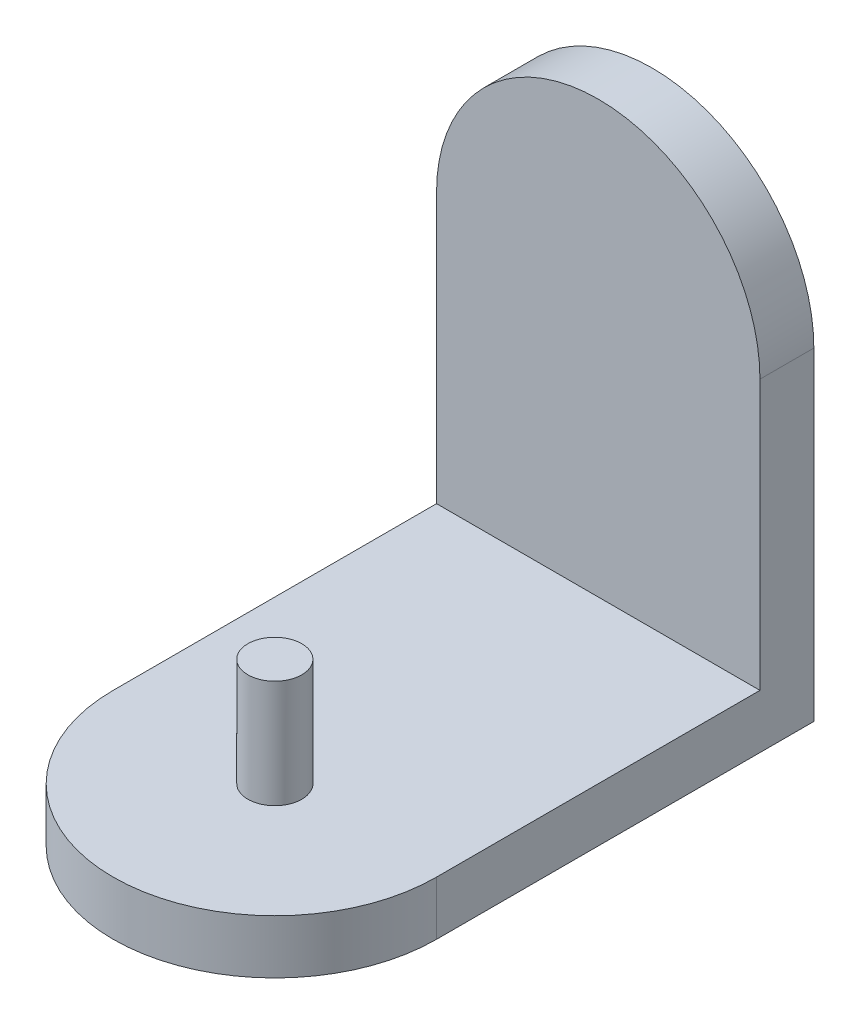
ISO-10303-21;
HEADER;
FILE_DESCRIPTION(('STEP AP214'),'2;1');
FILE_NAME('part.step','',(''),(''),'','','');
FILE_SCHEMA(('AUTOMOTIVE_DESIGN { 1 0 10303 214 1 1 1 1 }'));
ENDSEC;
DATA;
#1=APPLICATION_CONTEXT('core data for automotive mechanical design processes');
#2=APPLICATION_PROTOCOL_DEFINITION('international standard','automotive_design',2000,#1);
#3=PRODUCT_CONTEXT('',#1,'mechanical');
#4=PRODUCT('Part','Part','',(#3));
#5=PRODUCT_RELATED_PRODUCT_CATEGORY('part','',(#4));
#6=PRODUCT_DEFINITION_FORMATION('','',#4);
#7=PRODUCT_DEFINITION_CONTEXT('part definition',#1,'design');
#8=PRODUCT_DEFINITION('design','',#6,#7);
#9=PRODUCT_DEFINITION_SHAPE('','',#8);
#10=(LENGTH_UNIT() NAMED_UNIT(*) SI_UNIT(.MILLI.,.METRE.));
#11=(NAMED_UNIT(*) PLANE_ANGLE_UNIT() SI_UNIT($,.RADIAN.));
#12=(NAMED_UNIT(*) SI_UNIT($,.STERADIAN.) SOLID_ANGLE_UNIT());
#13=UNCERTAINTY_MEASURE_WITH_UNIT(LENGTH_MEASURE(1.E-05),#10,'distance_accuracy_value','');
#14=(GEOMETRIC_REPRESENTATION_CONTEXT(3) GLOBAL_UNCERTAINTY_ASSIGNED_CONTEXT((#13)) GLOBAL_UNIT_ASSIGNED_CONTEXT((#10,
#11,#12)) REPRESENTATION_CONTEXT('',''));
#15=CARTESIAN_POINT('',(0.,0.,0.));
#16=DIRECTION('',(0.,0.,1.));
#17=DIRECTION('',(1.,0.,0.));
#18=AXIS2_PLACEMENT_3D('',#15,#16,#17);
#19=CARTESIAN_POINT('',(15.,15.,5.));
#20=DIRECTION('',(-1.,0.,0.));
#21=DIRECTION('',(0.,-1.,0.));
#22=AXIS2_PLACEMENT_3D('',#19,#20,#21);
#23=PLANE('',#22);
#24=DIRECTION('',(0.,1.,0.));
#25=VECTOR('',#24,1.);
#26=CARTESIAN_POINT('',(15.,15.,0.));
#27=LINE('',#26,#25);
#28=CARTESIAN_POINT('',(15.,-15.,0.));
#29=VERTEX_POINT('',#28);
#30=CARTESIAN_POINT('',(15.,15.,0.));
#31=VERTEX_POINT('',#30);
#32=EDGE_CURVE('E94',#29,#31,#27,.T.);
#33=ORIENTED_EDGE('',*,*,#32,.T.);
#34=DIRECTION('',(0.,0.,-1.));
#35=VECTOR('',#34,1.);
#36=CARTESIAN_POINT('',(15.,15.,5.));
#37=LINE('',#36,#35);
#38=CARTESIAN_POINT('',(15.,15.,5.));
#39=VERTEX_POINT('',#38);
#40=EDGE_CURVE('E42',#39,#31,#37,.T.);
#41=ORIENTED_EDGE('',*,*,#40,.F.);
#42=DIRECTION('',(0.,1.,0.));
#43=VECTOR('',#42,1.);
#44=CARTESIAN_POINT('',(15.,15.,5.));
#45=LINE('',#44,#43);
#46=CARTESIAN_POINT('',(15.,-10.,5.));
#47=VERTEX_POINT('',#46);
#48=EDGE_CURVE('E87',#47,#39,#45,.T.);
#49=ORIENTED_EDGE('',*,*,#48,.F.);
#50=DIRECTION('',(0.,0.,-1.));
#51=VECTOR('',#50,1.);
#52=CARTESIAN_POINT('',(15.,-10.,35.));
#53=LINE('',#52,#51);
#54=CARTESIAN_POINT('',(15.,-10.,35.));
#55=VERTEX_POINT('',#54);
#56=EDGE_CURVE('E103',#55,#47,#53,.T.);
#57=ORIENTED_EDGE('',*,*,#56,.F.);
#58=DIRECTION('',(0.,1.,0.));
#59=VECTOR('',#58,1.);
#60=CARTESIAN_POINT('',(15.,-10.,35.));
#61=LINE('',#60,#59);
#62=CARTESIAN_POINT('',(15.,-15.,35.));
#63=VERTEX_POINT('',#62);
#64=EDGE_CURVE('E97',#63,#55,#61,.T.);
#65=ORIENTED_EDGE('',*,*,#64,.F.);
#66=DIRECTION('',(0.,0.,-1.));
#67=VECTOR('',#66,1.);
#68=CARTESIAN_POINT('',(15.,-15.,5.));
#69=LINE('',#68,#67);
#70=EDGE_CURVE('E80',#63,#29,#69,.T.);
#71=ORIENTED_EDGE('',*,*,#70,.T.);
#72=EDGE_LOOP('',(#33,#41,#49,#57,#65,#71));
#73=FACE_BOUND('',#72,.T.);
#74=ADVANCED_FACE('F35',(#73),#23,.F.);
#75=CARTESIAN_POINT('',(0.,15.,5.));
#76=DIRECTION('',(0.,0.,-1.));
#77=DIRECTION('',(-1.,0.,0.));
#78=AXIS2_PLACEMENT_3D('',#75,#76,#77);
#79=CYLINDRICAL_SURFACE('',#78,15.);
#80=CARTESIAN_POINT('',(0.,15.,0.));
#81=DIRECTION('',(0.,0.,1.));
#82=DIRECTION('',(1.,0.,0.));
#83=AXIS2_PLACEMENT_3D('',#80,#81,#82);
#84=CIRCLE('',#83,15.);
#85=CARTESIAN_POINT('',(-15.,15.,0.));
#86=VERTEX_POINT('',#85);
#87=EDGE_CURVE('E101',#31,#86,#84,.T.);
#88=ORIENTED_EDGE('',*,*,#87,.T.);
#89=DIRECTION('',(0.,0.,-1.));
#90=VECTOR('',#89,1.);
#91=CARTESIAN_POINT('',(-15.,15.,5.));
#92=LINE('',#91,#90);
#93=CARTESIAN_POINT('',(-15.,15.,5.));
#94=VERTEX_POINT('',#93);
#95=EDGE_CURVE('E114',#94,#86,#92,.T.);
#96=ORIENTED_EDGE('',*,*,#95,.F.);
#97=CARTESIAN_POINT('',(0.,15.,5.));
#98=DIRECTION('',(0.,0.,1.));
#99=DIRECTION('',(1.,0.,0.));
#100=AXIS2_PLACEMENT_3D('',#97,#98,#99);
#101=CIRCLE('',#100,15.);
#102=EDGE_CURVE('E55',#39,#94,#101,.T.);
#103=ORIENTED_EDGE('',*,*,#102,.F.);
#104=ORIENTED_EDGE('',*,*,#40,.T.);
#105=EDGE_LOOP('',(#88,#96,#103,#104));
#106=FACE_BOUND('',#105,.T.);
#107=ADVANCED_FACE('F117',(#106),#79,.T.);
#108=CARTESIAN_POINT('',(-15.,15.,5.));
#109=DIRECTION('',(1.,0.,0.));
#110=DIRECTION('',(0.,1.,0.));
#111=AXIS2_PLACEMENT_3D('',#108,#109,#110);
#112=PLANE('',#111);
#113=DIRECTION('',(0.,-1.,0.));
#114=VECTOR('',#113,1.);
#115=CARTESIAN_POINT('',(-15.,15.,0.));
#116=LINE('',#115,#114);
#117=CARTESIAN_POINT('',(-15.,-15.,0.));
#118=VERTEX_POINT('',#117);
#119=EDGE_CURVE('E88',#86,#118,#116,.T.);
#120=ORIENTED_EDGE('',*,*,#119,.T.);
#121=DIRECTION('',(0.,0.,-1.));
#122=VECTOR('',#121,1.);
#123=CARTESIAN_POINT('',(-15.,-15.,5.));
#124=LINE('',#123,#122);
#125=CARTESIAN_POINT('',(-15.,-15.,35.));
#126=VERTEX_POINT('',#125);
#127=EDGE_CURVE('E83',#126,#118,#124,.T.);
#128=ORIENTED_EDGE('',*,*,#127,.F.);
#129=DIRECTION('',(0.,-1.,0.));
#130=VECTOR('',#129,1.);
#131=CARTESIAN_POINT('',(-15.,-10.,35.));
#132=LINE('',#131,#130);
#133=CARTESIAN_POINT('',(-15.,-10.,35.));
#134=VERTEX_POINT('',#133);
#135=EDGE_CURVE('E141',#134,#126,#132,.T.);
#136=ORIENTED_EDGE('',*,*,#135,.F.);
#137=DIRECTION('',(0.,0.,-1.));
#138=VECTOR('',#137,1.);
#139=CARTESIAN_POINT('',(-15.,-10.,35.));
#140=LINE('',#139,#138);
#141=CARTESIAN_POINT('',(-15.,-10.,5.));
#142=VERTEX_POINT('',#141);
#143=EDGE_CURVE('E107',#134,#142,#140,.T.);
#144=ORIENTED_EDGE('',*,*,#143,.T.);
#145=DIRECTION('',(0.,-1.,0.));
#146=VECTOR('',#145,1.);
#147=CARTESIAN_POINT('',(-15.,15.,5.));
#148=LINE('',#147,#146);
#149=EDGE_CURVE('E98',#94,#142,#148,.T.);
#150=ORIENTED_EDGE('',*,*,#149,.F.);
#151=ORIENTED_EDGE('',*,*,#95,.T.);
#152=EDGE_LOOP('',(#120,#128,#136,#144,#150,#151));
#153=FACE_BOUND('',#152,.T.);
#154=ADVANCED_FACE('F147',(#153),#112,.F.);
#155=CARTESIAN_POINT('',(-15.,-15.,5.));
#156=DIRECTION('',(0.,1.,0.));
#157=DIRECTION('',(0.,0.,1.));
#158=AXIS2_PLACEMENT_3D('',#155,#156,#157);
#159=PLANE('',#158);
#160=DIRECTION('',(1.,0.,0.));
#161=VECTOR('',#160,1.);
#162=CARTESIAN_POINT('',(-15.,-15.,0.));
#163=LINE('',#162,#161);
#164=EDGE_CURVE('E75',#118,#29,#163,.T.);
#165=ORIENTED_EDGE('',*,*,#164,.T.);
#166=ORIENTED_EDGE('',*,*,#70,.F.);
#167=CARTESIAN_POINT('',(0.,-15.,35.));
#168=DIRECTION('',(0.,1.,0.));
#169=DIRECTION('',(0.,0.,1.));
#170=AXIS2_PLACEMENT_3D('',#167,#168,#169);
#171=CIRCLE('',#170,15.);
#172=EDGE_CURVE('E133',#63,#126,#171,.F.);
#173=ORIENTED_EDGE('',*,*,#172,.T.);
#174=ORIENTED_EDGE('',*,*,#127,.T.);
#175=EDGE_LOOP('',(#165,#166,#173,#174));
#176=FACE_BOUND('',#175,.T.);
#177=ADVANCED_FACE('F77',(#176),#159,.F.);
#178=CARTESIAN_POINT('',(0.,15.,5.));
#179=DIRECTION('',(0.,0.,1.));
#180=DIRECTION('',(1.,0.,0.));
#181=AXIS2_PLACEMENT_3D('',#178,#179,#180);
#182=PLANE('',#181);
#183=DIRECTION('',(-1.,0.,0.));
#184=VECTOR('',#183,1.);
#185=CARTESIAN_POINT('',(-15.,-10.,5.));
#186=LINE('',#185,#184);
#187=EDGE_CURVE('E49',#47,#142,#186,.T.);
#188=ORIENTED_EDGE('',*,*,#187,.F.);
#189=ORIENTED_EDGE('',*,*,#48,.T.);
#190=ORIENTED_EDGE('',*,*,#102,.T.);
#191=ORIENTED_EDGE('',*,*,#149,.T.);
#192=EDGE_LOOP('',(#188,#189,#190,#191));
#193=FACE_BOUND('',#192,.T.);
#194=ADVANCED_FACE('F145',(#193),#182,.T.);
#195=CARTESIAN_POINT('',(0.,15.,0.));
#196=DIRECTION('',(0.,0.,1.));
#197=DIRECTION('',(1.,0.,0.));
#198=AXIS2_PLACEMENT_3D('',#195,#196,#197);
#199=PLANE('',#198);
#200=ORIENTED_EDGE('',*,*,#32,.F.);
#201=ORIENTED_EDGE('',*,*,#164,.F.);
#202=ORIENTED_EDGE('',*,*,#119,.F.);
#203=ORIENTED_EDGE('',*,*,#87,.F.);
#204=EDGE_LOOP('',(#200,#201,#202,#203));
#205=FACE_BOUND('',#204,.T.);
#206=ADVANCED_FACE('F100',(#205),#199,.F.);
#207=CARTESIAN_POINT('',(-15.,-10.,35.));
#208=DIRECTION('',(0.,-1.,0.));
#209=DIRECTION('',(0.,0.,-1.));
#210=AXIS2_PLACEMENT_3D('',#207,#208,#209);
#211=PLANE('',#210);
#212=CARTESIAN_POINT('',(0.,-10.,35.));
#213=DIRECTION('',(0.,-1.,0.));
#214=DIRECTION('',(0.,0.,-1.));
#215=AXIS2_PLACEMENT_3D('',#212,#213,#214);
#216=CIRCLE('',#215,2.5);
#217=CARTESIAN_POINT('',(0.,-10.,32.5));
#218=VERTEX_POINT('',#217);
#219=EDGE_CURVE('E11',#218,#218,#216,.F.);
#220=ORIENTED_EDGE('',*,*,#219,.F.);
#221=EDGE_LOOP('',(#220));
#222=FACE_BOUND('',#221,.T.);
#223=ORIENTED_EDGE('',*,*,#187,.T.);
#224=ORIENTED_EDGE('',*,*,#143,.F.);
#225=CARTESIAN_POINT('',(0.,-10.,35.));
#226=DIRECTION('',(0.,1.,0.));
#227=DIRECTION('',(0.,0.,1.));
#228=AXIS2_PLACEMENT_3D('',#225,#226,#227);
#229=CIRCLE('',#228,15.);
#230=EDGE_CURVE('E127',#134,#55,#229,.T.);
#231=ORIENTED_EDGE('',*,*,#230,.T.);
#232=ORIENTED_EDGE('',*,*,#56,.T.);
#233=EDGE_LOOP('',(#223,#224,#231,#232));
#234=FACE_BOUND('',#233,.T.);
#235=ADVANCED_FACE('F122',(#222,#234),#211,.F.);
#236=CARTESIAN_POINT('',(0.,-48.5410196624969,35.));
#237=DIRECTION('',(0.,1.,0.));
#238=DIRECTION('',(0.,0.,1.));
#239=AXIS2_PLACEMENT_3D('',#236,#237,#238);
#240=CYLINDRICAL_SURFACE('',#239,15.);
#241=ORIENTED_EDGE('',*,*,#172,.F.);
#242=ORIENTED_EDGE('',*,*,#64,.T.);
#243=ORIENTED_EDGE('',*,*,#230,.F.);
#244=ORIENTED_EDGE('',*,*,#135,.T.);
#245=EDGE_LOOP('',(#241,#242,#243,#244));
#246=FACE_BOUND('',#245,.T.);
#247=ADVANCED_FACE('F149',(#246),#240,.T.);
#248=CARTESIAN_POINT('',(0.,0.,35.));
#249=DIRECTION('',(0.,-1.,0.));
#250=DIRECTION('',(0.,0.,-1.));
#251=AXIS2_PLACEMENT_3D('',#248,#249,#250);
#252=CYLINDRICAL_SURFACE('',#251,2.5);
#253=CARTESIAN_POINT('',(0.,0.,35.));
#254=DIRECTION('',(0.,1.,0.));
#255=DIRECTION('',(0.,0.,1.));
#256=AXIS2_PLACEMENT_3D('',#253,#254,#255);
#257=CIRCLE('',#256,2.5);
#258=CARTESIAN_POINT('',(0.,0.,37.5));
#259=VERTEX_POINT('',#258);
#260=EDGE_CURVE('E134',#259,#259,#257,.T.);
#261=ORIENTED_EDGE('',*,*,#260,.F.);
#262=EDGE_LOOP('',(#261));
#263=FACE_BOUND('',#262,.T.);
#264=ORIENTED_EDGE('',*,*,#219,.T.);
#265=EDGE_LOOP('',(#264));
#266=FACE_BOUND('',#265,.T.);
#267=ADVANCED_FACE('F153',(#263,#266),#252,.T.);
#268=CARTESIAN_POINT('',(0.,0.,35.));
#269=DIRECTION('',(0.,1.,0.));
#270=DIRECTION('',(0.,0.,1.));
#271=AXIS2_PLACEMENT_3D('',#268,#269,#270);
#272=PLANE('',#271);
#273=ORIENTED_EDGE('',*,*,#260,.T.);
#274=EDGE_LOOP('',(#273));
#275=FACE_BOUND('',#274,.T.);
#276=ADVANCED_FACE('F159',(#275),#272,.T.);
#277=CLOSED_SHELL('',(#74,#107,#154,#177,#194,#206,#235,#247,#267,#276));
#278=MANIFOLD_SOLID_BREP('B2',#277);
#279=ADVANCED_BREP_SHAPE_REPRESENTATION('',(#18,#278),#14);
#280=SHAPE_DEFINITION_REPRESENTATION(#9,#279);
ENDSEC;
END-ISO-10303-21;
